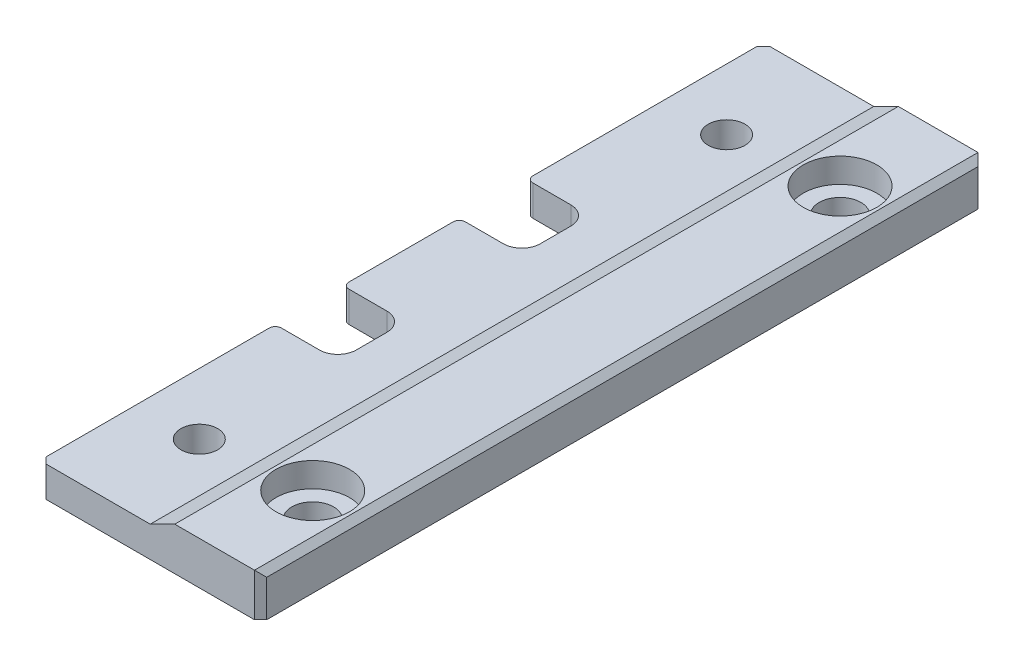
ISO-10303-21;
HEADER;
FILE_DESCRIPTION(('STEP AP214'),'2;1');
FILE_NAME('part.step','',(''),(''),'','','');
FILE_SCHEMA(('AUTOMOTIVE_DESIGN { 1 0 10303 214 1 1 1 1 }'));
ENDSEC;
DATA;
#1=APPLICATION_CONTEXT('core data for automotive mechanical design processes');
#2=APPLICATION_PROTOCOL_DEFINITION('international standard','automotive_design',2000,#1);
#3=PRODUCT_CONTEXT('',#1,'mechanical');
#4=PRODUCT('Part','Part','',(#3));
#5=PRODUCT_RELATED_PRODUCT_CATEGORY('part','',(#4));
#6=PRODUCT_DEFINITION_FORMATION('','',#4);
#7=PRODUCT_DEFINITION_CONTEXT('part definition',#1,'design');
#8=PRODUCT_DEFINITION('design','',#6,#7);
#9=PRODUCT_DEFINITION_SHAPE('','',#8);
#10=(LENGTH_UNIT() NAMED_UNIT(*) SI_UNIT(.MILLI.,.METRE.));
#11=(NAMED_UNIT(*) PLANE_ANGLE_UNIT() SI_UNIT($,.RADIAN.));
#12=(NAMED_UNIT(*) SI_UNIT($,.STERADIAN.) SOLID_ANGLE_UNIT());
#13=UNCERTAINTY_MEASURE_WITH_UNIT(LENGTH_MEASURE(1.E-05),#10,'distance_accuracy_value','');
#14=(GEOMETRIC_REPRESENTATION_CONTEXT(3) GLOBAL_UNCERTAINTY_ASSIGNED_CONTEXT((#13)) GLOBAL_UNIT_ASSIGNED_CONTEXT((#10,
#11,#12)) REPRESENTATION_CONTEXT('',''));
#15=CARTESIAN_POINT('',(0.,0.,0.));
#16=DIRECTION('',(0.,0.,1.));
#17=DIRECTION('',(1.,0.,0.));
#18=AXIS2_PLACEMENT_3D('',#15,#16,#17);
#19=CARTESIAN_POINT('',(-139.878100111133,4.07757026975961,-51.));
#20=DIRECTION('',(0.,1.,0.));
#21=DIRECTION('',(0.,0.,1.));
#22=AXIS2_PLACEMENT_3D('',#19,#20,#21);
#23=CYLINDRICAL_SURFACE('',#22,1.7);
#24=CARTESIAN_POINT('',(-139.878100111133,4.07757026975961,-51.));
#25=DIRECTION('',(0.,1.,0.));
#26=DIRECTION('',(0.,0.,1.));
#27=AXIS2_PLACEMENT_3D('',#24,#25,#26);
#28=CIRCLE('',#27,1.7);
#29=CARTESIAN_POINT('',(-139.878100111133,4.07757026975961,-49.3));
#30=VERTEX_POINT('',#29);
#31=EDGE_CURVE('E358',#30,#30,#28,.T.);
#32=ORIENTED_EDGE('',*,*,#31,.F.);
#33=EDGE_LOOP('',(#32));
#34=FACE_BOUND('',#33,.T.);
#35=CARTESIAN_POINT('',(-139.878100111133,5.57757026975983,-51.));
#36=DIRECTION('',(0.,1.,0.));
#37=DIRECTION('',(0.,0.,1.));
#38=AXIS2_PLACEMENT_3D('',#35,#36,#37);
#39=CIRCLE('',#38,1.7);
#40=CARTESIAN_POINT('',(-139.878100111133,5.57757026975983,-49.3));
#41=VERTEX_POINT('',#40);
#42=EDGE_CURVE('E361',#41,#41,#39,.F.);
#43=ORIENTED_EDGE('',*,*,#42,.F.);
#44=EDGE_LOOP('',(#43));
#45=FACE_BOUND('',#44,.T.);
#46=ADVANCED_FACE('F16',(#34,#45),#23,.F.);
#47=CARTESIAN_POINT('',(-154.128100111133,6.57757026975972,-59.));
#48=DIRECTION('',(-1.,0.,0.));
#49=DIRECTION('',(0.,0.,1.));
#50=AXIS2_PLACEMENT_3D('',#47,#48,#49);
#51=PLANE('',#50);
#52=DIRECTION('',(0.,0.,1.));
#53=VECTOR('',#52,1.);
#54=CARTESIAN_POINT('',(-154.128100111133,6.57757026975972,-59.));
#55=LINE('',#54,#53);
#56=CARTESIAN_POINT('',(-154.128100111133,6.57757026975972,-58.5));
#57=VERTEX_POINT('',#56);
#58=CARTESIAN_POINT('',(-154.128100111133,6.57757026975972,-40.2));
#59=VERTEX_POINT('',#58);
#60=EDGE_CURVE('E235',#57,#59,#55,.T.);
#61=ORIENTED_EDGE('',*,*,#60,.F.);
#62=DIRECTION('',(0.,-1.,0.));
#63=VECTOR('',#62,1.);
#64=CARTESIAN_POINT('',(-154.128100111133,4.07757026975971,-58.5));
#65=LINE('',#64,#63);
#66=CARTESIAN_POINT('',(-154.128100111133,4.07757026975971,-58.5));
#67=VERTEX_POINT('',#66);
#68=EDGE_CURVE('E325',#57,#67,#65,.T.);
#69=ORIENTED_EDGE('',*,*,#68,.T.);
#70=DIRECTION('',(0.,0.,1.));
#71=VECTOR('',#70,1.);
#72=CARTESIAN_POINT('',(-154.128100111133,4.07757026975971,-59.));
#73=LINE('',#72,#71);
#74=CARTESIAN_POINT('',(-154.128100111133,4.07757026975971,-40.2));
#75=VERTEX_POINT('',#74);
#76=EDGE_CURVE('E230',#67,#75,#73,.T.);
#77=ORIENTED_EDGE('',*,*,#76,.T.);
#78=DIRECTION('',(0.,-1.,0.));
#79=VECTOR('',#78,1.);
#80=CARTESIAN_POINT('',(-154.128100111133,6.57757026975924,-40.2));
#81=LINE('',#80,#79);
#82=EDGE_CURVE('E304',#75,#59,#81,.F.);
#83=ORIENTED_EDGE('',*,*,#82,.T.);
#84=EDGE_LOOP('',(#61,#69,#77,#83));
#85=FACE_BOUND('',#84,.T.);
#86=ADVANCED_FACE('F434',(#85),#51,.T.);
#87=CARTESIAN_POINT('',(-154.128100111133,6.57757026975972,-33.7));
#88=VERTEX_POINT('',#87);
#89=CARTESIAN_POINT('',(-154.128100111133,6.57757026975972,-25.2));
#90=VERTEX_POINT('',#89);
#91=EDGE_CURVE('E237',#88,#90,#55,.T.);
#92=ORIENTED_EDGE('',*,*,#91,.F.);
#93=DIRECTION('',(0.,1.,0.));
#94=VECTOR('',#93,1.);
#95=CARTESIAN_POINT('',(-154.128100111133,4.07757026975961,-33.7));
#96=LINE('',#95,#94);
#97=CARTESIAN_POINT('',(-154.128100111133,4.07757026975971,-33.7));
#98=VERTEX_POINT('',#97);
#99=EDGE_CURVE('E294',#88,#98,#96,.F.);
#100=ORIENTED_EDGE('',*,*,#99,.T.);
#101=CARTESIAN_POINT('',(-154.128100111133,4.07757026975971,-25.2));
#102=VERTEX_POINT('',#101);
#103=EDGE_CURVE('E233',#98,#102,#73,.T.);
#104=ORIENTED_EDGE('',*,*,#103,.T.);
#105=DIRECTION('',(0.,-1.,0.));
#106=VECTOR('',#105,1.);
#107=CARTESIAN_POINT('',(-154.128100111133,6.57757026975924,-25.2));
#108=LINE('',#107,#106);
#109=EDGE_CURVE('E262',#102,#90,#108,.F.);
#110=ORIENTED_EDGE('',*,*,#109,.T.);
#111=EDGE_LOOP('',(#92,#100,#104,#110));
#112=FACE_BOUND('',#111,.T.);
#113=ADVANCED_FACE('F441',(#112),#51,.T.);
#114=CARTESIAN_POINT('',(-154.128100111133,4.07757026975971,-59.));
#115=DIRECTION('',(0.,-1.,0.));
#116=DIRECTION('',(0.,0.,-1.));
#117=AXIS2_PLACEMENT_3D('',#114,#115,#116);
#118=PLANE('',#117);
#119=CARTESIAN_POINT('',(-149.128100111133,4.07757026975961,-51.));
#120=DIRECTION('',(0.,1.,0.));
#121=DIRECTION('',(0.,0.,1.));
#122=AXIS2_PLACEMENT_3D('',#119,#120,#121);
#123=CIRCLE('',#122,1.5);
#124=CARTESIAN_POINT('',(-149.128100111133,4.07757026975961,-49.5));
#125=VERTEX_POINT('',#124);
#126=EDGE_CURVE('E619',#125,#125,#123,.T.);
#127=ORIENTED_EDGE('',*,*,#126,.T.);
#128=EDGE_LOOP('',(#127));
#129=FACE_BOUND('',#128,.T.);
#130=CARTESIAN_POINT('',(-149.128100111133,4.07757026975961,-8.));
#131=DIRECTION('',(0.,1.,0.));
#132=DIRECTION('',(0.,0.,1.));
#133=AXIS2_PLACEMENT_3D('',#130,#131,#132);
#134=CIRCLE('',#133,1.5);
#135=CARTESIAN_POINT('',(-149.128100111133,4.07757026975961,-6.5));
#136=VERTEX_POINT('',#135);
#137=EDGE_CURVE('E612',#136,#136,#134,.T.);
#138=ORIENTED_EDGE('',*,*,#137,.T.);
#139=EDGE_LOOP('',(#138));
#140=FACE_BOUND('',#139,.T.);
#141=CARTESIAN_POINT('',(-139.878100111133,4.07757026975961,-8.));
#142=DIRECTION('',(0.,1.,0.));
#143=DIRECTION('',(0.,0.,-1.));
#144=AXIS2_PLACEMENT_3D('',#141,#142,#143);
#145=CIRCLE('',#144,1.7);
#146=CARTESIAN_POINT('',(-139.878100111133,4.07757026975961,-9.7));
#147=VERTEX_POINT('',#146);
#148=EDGE_CURVE('E363',#147,#147,#145,.T.);
#149=ORIENTED_EDGE('',*,*,#148,.T.);
#150=EDGE_LOOP('',(#149));
#151=FACE_BOUND('',#150,.T.);
#152=ORIENTED_EDGE('',*,*,#31,.T.);
#153=EDGE_LOOP('',(#152));
#154=FACE_BOUND('',#153,.T.);
#155=ORIENTED_EDGE('',*,*,#76,.F.);
#156=DIRECTION('',(0.707106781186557,0.,-0.707106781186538));
#157=VECTOR('',#156,1.);
#158=CARTESIAN_POINT('',(-153.878100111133,4.07757026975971,-58.75));
#159=LINE('',#158,#157);
#160=CARTESIAN_POINT('',(-153.628100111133,4.07757026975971,-59.));
#161=VERTEX_POINT('',#160);
#162=EDGE_CURVE('E334',#67,#161,#159,.T.);
#163=ORIENTED_EDGE('',*,*,#162,.T.);
#164=DIRECTION('',(1.,0.,0.));
#165=VECTOR('',#164,1.);
#166=CARTESIAN_POINT('',(-154.128100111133,4.07757026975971,-59.));
#167=LINE('',#166,#165);
#168=CARTESIAN_POINT('',(-136.628100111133,4.07757026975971,-59.));
#169=VERTEX_POINT('',#168);
#170=EDGE_CURVE('E202',#161,#169,#167,.T.);
#171=ORIENTED_EDGE('',*,*,#170,.T.);
#172=DIRECTION('',(0.707106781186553,0.,0.707106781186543));
#173=VECTOR('',#172,1.);
#174=CARTESIAN_POINT('',(-145.378100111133,4.07757026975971,-67.75));
#175=LINE('',#174,#173);
#176=CARTESIAN_POINT('',(-136.128100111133,4.07757026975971,-58.5));
#177=VERTEX_POINT('',#176);
#178=EDGE_CURVE('E332',#169,#177,#175,.T.);
#179=ORIENTED_EDGE('',*,*,#178,.T.);
#180=DIRECTION('',(0.,0.,1.));
#181=VECTOR('',#180,1.);
#182=CARTESIAN_POINT('',(-136.128100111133,4.07757026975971,-59.));
#183=LINE('',#182,#181);
#184=CARTESIAN_POINT('',(-136.128100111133,4.07757026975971,-0.500000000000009));
#185=VERTEX_POINT('',#184);
#186=EDGE_CURVE('E210',#177,#185,#183,.T.);
#187=ORIENTED_EDGE('',*,*,#186,.T.);
#188=DIRECTION('',(0.707106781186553,0.,-0.707106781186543));
#189=VECTOR('',#188,1.);
#190=CARTESIAN_POINT('',(-115.878100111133,4.07757026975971,-20.7499999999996));
#191=LINE('',#190,#189);
#192=CARTESIAN_POINT('',(-136.628100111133,4.07757026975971,0.));
#193=VERTEX_POINT('',#192);
#194=EDGE_CURVE('E330',#185,#193,#191,.F.);
#195=ORIENTED_EDGE('',*,*,#194,.T.);
#196=DIRECTION('',(1.,0.,0.));
#197=VECTOR('',#196,1.);
#198=CARTESIAN_POINT('',(-154.128100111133,4.07757026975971,0.));
#199=LINE('',#198,#197);
#200=CARTESIAN_POINT('',(-153.628100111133,4.07757026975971,0.));
#201=VERTEX_POINT('',#200);
#202=EDGE_CURVE('E221',#201,#193,#199,.T.);
#203=ORIENTED_EDGE('',*,*,#202,.F.);
#204=DIRECTION('',(0.707106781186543,0.,0.707106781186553));
#205=VECTOR('',#204,1.);
#206=CARTESIAN_POINT('',(-183.378100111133,4.07757026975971,-29.7500000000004));
#207=LINE('',#206,#205);
#208=CARTESIAN_POINT('',(-154.128100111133,4.07757026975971,-0.500000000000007));
#209=VERTEX_POINT('',#208);
#210=EDGE_CURVE('E328',#201,#209,#207,.F.);
#211=ORIENTED_EDGE('',*,*,#210,.T.);
#212=CARTESIAN_POINT('',(-154.128100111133,4.07757026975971,-18.7));
#213=VERTEX_POINT('',#212);
#214=EDGE_CURVE('E234',#213,#209,#73,.T.);
#215=ORIENTED_EDGE('',*,*,#214,.F.);
#216=CARTESIAN_POINT('',(-153.628100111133,4.07757026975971,-18.7));
#217=DIRECTION('',(0.,-1.,0.));
#218=DIRECTION('',(0.,0.,-1.));
#219=AXIS2_PLACEMENT_3D('',#216,#217,#218);
#220=CIRCLE('',#219,0.5);
#221=CARTESIAN_POINT('',(-153.628100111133,4.07757026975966,-19.2));
#222=VERTEX_POINT('',#221);
#223=EDGE_CURVE('E257',#213,#222,#220,.T.);
#224=ORIENTED_EDGE('',*,*,#223,.T.);
#225=DIRECTION('',(1.,0.,0.));
#226=VECTOR('',#225,1.);
#227=CARTESIAN_POINT('',(-155.131755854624,4.07757026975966,-19.2));
#228=LINE('',#227,#226);
#229=CARTESIAN_POINT('',(-150.528100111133,4.07757026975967,-19.2));
#230=VERTEX_POINT('',#229);
#231=EDGE_CURVE('E395',#222,#230,#228,.T.);
#232=ORIENTED_EDGE('',*,*,#231,.T.);
#233=CARTESIAN_POINT('',(-150.528100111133,4.07757026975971,-20.7));
#234=DIRECTION('',(0.,-1.,0.));
#235=DIRECTION('',(0.,0.,-1.));
#236=AXIS2_PLACEMENT_3D('',#233,#234,#235);
#237=CIRCLE('',#236,1.5);
#238=CARTESIAN_POINT('',(-149.028100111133,4.07757026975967,-20.7));
#239=VERTEX_POINT('',#238);
#240=EDGE_CURVE('E277',#230,#239,#237,.F.);
#241=ORIENTED_EDGE('',*,*,#240,.T.);
#242=DIRECTION('',(0.,0.,-1.));
#243=VECTOR('',#242,1.);
#244=CARTESIAN_POINT('',(-149.028100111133,4.07757026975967,-19.2));
#245=LINE('',#244,#243);
#246=CARTESIAN_POINT('',(-149.028100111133,4.07757026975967,-23.2));
#247=VERTEX_POINT('',#246);
#248=EDGE_CURVE('E398',#239,#247,#245,.T.);
#249=ORIENTED_EDGE('',*,*,#248,.T.);
#250=CARTESIAN_POINT('',(-150.528100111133,4.07757026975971,-23.2));
#251=DIRECTION('',(0.,-1.,0.));
#252=DIRECTION('',(0.,0.,-1.));
#253=AXIS2_PLACEMENT_3D('',#250,#251,#252);
#254=CIRCLE('',#253,1.5);
#255=CARTESIAN_POINT('',(-150.528100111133,4.07757026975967,-24.7));
#256=VERTEX_POINT('',#255);
#257=EDGE_CURVE('E281',#247,#256,#254,.F.);
#258=ORIENTED_EDGE('',*,*,#257,.T.);
#259=DIRECTION('',(-1.,0.,0.));
#260=VECTOR('',#259,1.);
#261=CARTESIAN_POINT('',(-155.131755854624,4.07757026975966,-24.7));
#262=LINE('',#261,#260);
#263=CARTESIAN_POINT('',(-153.628100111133,4.07757026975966,-24.7));
#264=VERTEX_POINT('',#263);
#265=EDGE_CURVE('E224',#256,#264,#262,.T.);
#266=ORIENTED_EDGE('',*,*,#265,.T.);
#267=CARTESIAN_POINT('',(-153.628100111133,4.07757026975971,-25.2));
#268=DIRECTION('',(0.,-1.,0.));
#269=DIRECTION('',(0.,0.,-1.));
#270=AXIS2_PLACEMENT_3D('',#267,#268,#269);
#271=CIRCLE('',#270,0.5);
#272=EDGE_CURVE('E254',#264,#102,#271,.T.);
#273=ORIENTED_EDGE('',*,*,#272,.T.);
#274=ORIENTED_EDGE('',*,*,#103,.F.);
#275=CARTESIAN_POINT('',(-153.628100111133,4.07757026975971,-33.7));
#276=DIRECTION('',(0.,-1.,0.));
#277=DIRECTION('',(0.,0.,-1.));
#278=AXIS2_PLACEMENT_3D('',#275,#276,#277);
#279=CIRCLE('',#278,0.5);
#280=CARTESIAN_POINT('',(-153.628100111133,4.07757026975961,-34.2));
#281=VERTEX_POINT('',#280);
#282=EDGE_CURVE('E299',#98,#281,#279,.T.);
#283=ORIENTED_EDGE('',*,*,#282,.T.);
#284=DIRECTION('',(1.,0.,0.));
#285=VECTOR('',#284,1.);
#286=CARTESIAN_POINT('',(-155.131755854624,4.0775702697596,-34.2));
#287=LINE('',#286,#285);
#288=CARTESIAN_POINT('',(-150.528100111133,4.07757026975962,-34.2));
#289=VERTEX_POINT('',#288);
#290=EDGE_CURVE('E382',#281,#289,#287,.T.);
#291=ORIENTED_EDGE('',*,*,#290,.T.);
#292=CARTESIAN_POINT('',(-150.528100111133,4.07757026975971,-35.7));
#293=DIRECTION('',(0.,-1.,0.));
#294=DIRECTION('',(0.,0.,-1.));
#295=AXIS2_PLACEMENT_3D('',#292,#293,#294);
#296=CIRCLE('',#295,1.5);
#297=CARTESIAN_POINT('',(-149.028100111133,4.07757026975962,-35.7));
#298=VERTEX_POINT('',#297);
#299=EDGE_CURVE('E319',#289,#298,#296,.F.);
#300=ORIENTED_EDGE('',*,*,#299,.T.);
#301=DIRECTION('',(0.,0.,-1.));
#302=VECTOR('',#301,1.);
#303=CARTESIAN_POINT('',(-149.028100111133,4.07757026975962,-34.2));
#304=LINE('',#303,#302);
#305=CARTESIAN_POINT('',(-149.028100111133,4.07757026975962,-38.2));
#306=VERTEX_POINT('',#305);
#307=EDGE_CURVE('E385',#298,#306,#304,.T.);
#308=ORIENTED_EDGE('',*,*,#307,.T.);
#309=CARTESIAN_POINT('',(-150.528100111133,4.07757026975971,-38.2));
#310=DIRECTION('',(0.,-1.,0.));
#311=DIRECTION('',(0.,0.,-1.));
#312=AXIS2_PLACEMENT_3D('',#309,#310,#311);
#313=CIRCLE('',#312,1.5);
#314=CARTESIAN_POINT('',(-150.528100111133,4.07757026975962,-39.7));
#315=VERTEX_POINT('',#314);
#316=EDGE_CURVE('E323',#306,#315,#313,.F.);
#317=ORIENTED_EDGE('',*,*,#316,.T.);
#318=DIRECTION('',(-1.,0.,0.));
#319=VECTOR('',#318,1.);
#320=CARTESIAN_POINT('',(-155.131755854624,4.0775702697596,-39.7));
#321=LINE('',#320,#319);
#322=CARTESIAN_POINT('',(-153.628100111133,4.07757026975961,-39.7));
#323=VERTEX_POINT('',#322);
#324=EDGE_CURVE('E389',#315,#323,#321,.T.);
#325=ORIENTED_EDGE('',*,*,#324,.T.);
#326=CARTESIAN_POINT('',(-153.628100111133,4.07757026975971,-40.2));
#327=DIRECTION('',(0.,-1.,0.));
#328=DIRECTION('',(0.,0.,-1.));
#329=AXIS2_PLACEMENT_3D('',#326,#327,#328);
#330=CIRCLE('',#329,0.5);
#331=EDGE_CURVE('E296',#323,#75,#330,.T.);
#332=ORIENTED_EDGE('',*,*,#331,.T.);
#333=EDGE_LOOP('',(#155,#163,#171,#179,#187,#195,#203,#211,#215,#224,#232,#241,#249,#258,#266,
#273,#274,#283,#291,#300,#308,#317,#325,#332));
#334=FACE_BOUND('',#333,.T.);
#335=ADVANCED_FACE('F409',(#129,#140,#151,#154,#334),#118,.T.);
#336=ORIENTED_EDGE('',*,*,#214,.T.);
#337=DIRECTION('',(0.,1.,0.));
#338=VECTOR('',#337,1.);
#339=CARTESIAN_POINT('',(-154.128100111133,6.57757026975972,-0.500000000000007));
#340=LINE('',#339,#338);
#341=CARTESIAN_POINT('',(-154.128100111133,6.57757026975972,-0.5));
#342=VERTEX_POINT('',#341);
#343=EDGE_CURVE('E11',#209,#342,#340,.T.);
#344=ORIENTED_EDGE('',*,*,#343,.T.);
#345=CARTESIAN_POINT('',(-154.128100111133,6.57757026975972,-18.7));
#346=VERTEX_POINT('',#345);
#347=EDGE_CURVE('E238',#346,#342,#55,.T.);
#348=ORIENTED_EDGE('',*,*,#347,.F.);
#349=DIRECTION('',(0.,1.,0.));
#350=VECTOR('',#349,1.);
#351=CARTESIAN_POINT('',(-154.128100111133,4.07757026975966,-18.7));
#352=LINE('',#351,#350);
#353=EDGE_CURVE('E252',#346,#213,#352,.F.);
#354=ORIENTED_EDGE('',*,*,#353,.T.);
#355=EDGE_LOOP('',(#336,#344,#348,#354));
#356=FACE_BOUND('',#355,.T.);
#357=ADVANCED_FACE('F444',(#356),#51,.T.);
#358=CARTESIAN_POINT('',(-145.128100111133,6.57757026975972,-59.));
#359=DIRECTION('',(0.,1.,0.));
#360=DIRECTION('',(0.,0.,1.));
#361=AXIS2_PLACEMENT_3D('',#358,#359,#360);
#362=PLANE('',#361);
#363=CARTESIAN_POINT('',(-149.128100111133,6.57757026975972,-51.));
#364=DIRECTION('',(0.,1.,0.));
#365=DIRECTION('',(0.,0.,1.));
#366=AXIS2_PLACEMENT_3D('',#363,#364,#365);
#367=CIRCLE('',#366,1.49999999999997);
#368=CARTESIAN_POINT('',(-149.128100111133,6.57757026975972,-49.5));
#369=VERTEX_POINT('',#368);
#370=EDGE_CURVE('E622',#369,#369,#367,.T.);
#371=ORIENTED_EDGE('',*,*,#370,.F.);
#372=EDGE_LOOP('',(#371));
#373=FACE_BOUND('',#372,.T.);
#374=CARTESIAN_POINT('',(-149.128100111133,6.57757026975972,-8.));
#375=DIRECTION('',(0.,1.,0.));
#376=DIRECTION('',(0.,0.,1.));
#377=AXIS2_PLACEMENT_3D('',#374,#375,#376);
#378=CIRCLE('',#377,1.49999999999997);
#379=CARTESIAN_POINT('',(-149.128100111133,6.57757026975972,-6.50000000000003));
#380=VERTEX_POINT('',#379);
#381=EDGE_CURVE('E616',#380,#380,#378,.T.);
#382=ORIENTED_EDGE('',*,*,#381,.F.);
#383=EDGE_LOOP('',(#382));
#384=FACE_BOUND('',#383,.T.);
#385=DIRECTION('',(-1.,0.,0.));
#386=VECTOR('',#385,1.);
#387=CARTESIAN_POINT('',(-145.128100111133,6.57757026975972,-59.));
#388=LINE('',#387,#386);
#389=CARTESIAN_POINT('',(-145.128100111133,6.57757026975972,-59.));
#390=VERTEX_POINT('',#389);
#391=CARTESIAN_POINT('',(-153.628100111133,6.57757026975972,-59.));
#392=VERTEX_POINT('',#391);
#393=EDGE_CURVE('E216',#390,#392,#388,.T.);
#394=ORIENTED_EDGE('',*,*,#393,.T.);
#395=DIRECTION('',(-0.707106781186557,0.,0.707106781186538));
#396=VECTOR('',#395,1.);
#397=CARTESIAN_POINT('',(-149.378100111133,6.57757026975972,-63.25));
#398=LINE('',#397,#396);
#399=EDGE_CURVE('E342',#392,#57,#398,.T.);
#400=ORIENTED_EDGE('',*,*,#399,.T.);
#401=ORIENTED_EDGE('',*,*,#60,.T.);
#402=CARTESIAN_POINT('',(-153.628100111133,6.57757026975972,-40.2));
#403=DIRECTION('',(0.,1.,0.));
#404=DIRECTION('',(0.,0.,1.));
#405=AXIS2_PLACEMENT_3D('',#402,#403,#404);
#406=CIRCLE('',#405,0.5);
#407=CARTESIAN_POINT('',(-153.628100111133,6.57757026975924,-39.7));
#408=VERTEX_POINT('',#407);
#409=EDGE_CURVE('E289',#59,#408,#406,.T.);
#410=ORIENTED_EDGE('',*,*,#409,.T.);
#411=DIRECTION('',(-1.,0.,0.));
#412=VECTOR('',#411,1.);
#413=CARTESIAN_POINT('',(-155.131755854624,6.57757026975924,-39.7));
#414=LINE('',#413,#412);
#415=CARTESIAN_POINT('',(-150.528100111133,6.57757026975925,-39.7));
#416=VERTEX_POINT('',#415);
#417=EDGE_CURVE('E386',#416,#408,#414,.T.);
#418=ORIENTED_EDGE('',*,*,#417,.F.);
#419=CARTESIAN_POINT('',(-150.528100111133,6.57757026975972,-38.2));
#420=DIRECTION('',(0.,1.,0.));
#421=DIRECTION('',(0.,0.,1.));
#422=AXIS2_PLACEMENT_3D('',#419,#420,#421);
#423=CIRCLE('',#422,1.5);
#424=CARTESIAN_POINT('',(-149.028100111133,6.57757026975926,-38.2));
#425=VERTEX_POINT('',#424);
#426=EDGE_CURVE('E321',#416,#425,#423,.F.);
#427=ORIENTED_EDGE('',*,*,#426,.T.);
#428=DIRECTION('',(0.,0.,-1.));
#429=VECTOR('',#428,1.);
#430=CARTESIAN_POINT('',(-149.028100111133,6.57757026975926,-34.2));
#431=LINE('',#430,#429);
#432=CARTESIAN_POINT('',(-149.028100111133,6.57757026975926,-35.7));
#433=VERTEX_POINT('',#432);
#434=EDGE_CURVE('E360',#433,#425,#431,.T.);
#435=ORIENTED_EDGE('',*,*,#434,.F.);
#436=CARTESIAN_POINT('',(-150.528100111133,6.57757026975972,-35.7));
#437=DIRECTION('',(0.,1.,0.));
#438=DIRECTION('',(0.,0.,1.));
#439=AXIS2_PLACEMENT_3D('',#436,#437,#438);
#440=CIRCLE('',#439,1.5);
#441=CARTESIAN_POINT('',(-150.528100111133,6.57757026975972,-34.2));
#442=VERTEX_POINT('',#441);
#443=EDGE_CURVE('E317',#433,#442,#440,.F.);
#444=ORIENTED_EDGE('',*,*,#443,.T.);
#445=DIRECTION('',(1.,0.,0.));
#446=VECTOR('',#445,1.);
#447=CARTESIAN_POINT('',(-145.128100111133,6.57757026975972,-34.2));
#448=LINE('',#447,#446);
#449=CARTESIAN_POINT('',(-153.628100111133,6.57757026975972,-34.2));
#450=VERTEX_POINT('',#449);
#451=EDGE_CURVE('E283',#450,#442,#448,.T.);
#452=ORIENTED_EDGE('',*,*,#451,.F.);
#453=CARTESIAN_POINT('',(-153.628100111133,6.57757026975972,-33.7));
#454=DIRECTION('',(0.,1.,0.));
#455=DIRECTION('',(0.,0.,1.));
#456=AXIS2_PLACEMENT_3D('',#453,#454,#455);
#457=CIRCLE('',#456,0.5);
#458=EDGE_CURVE('E292',#450,#88,#457,.T.);
#459=ORIENTED_EDGE('',*,*,#458,.T.);
#460=ORIENTED_EDGE('',*,*,#91,.T.);
#461=CARTESIAN_POINT('',(-153.628100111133,6.57757026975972,-25.2));
#462=DIRECTION('',(0.,1.,0.));
#463=DIRECTION('',(0.,0.,1.));
#464=AXIS2_PLACEMENT_3D('',#461,#462,#463);
#465=CIRCLE('',#464,0.5);
#466=CARTESIAN_POINT('',(-153.628100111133,6.57757026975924,-24.7));
#467=VERTEX_POINT('',#466);
#468=EDGE_CURVE('E247',#90,#467,#465,.T.);
#469=ORIENTED_EDGE('',*,*,#468,.T.);
#470=DIRECTION('',(-1.,0.,0.));
#471=VECTOR('',#470,1.);
#472=CARTESIAN_POINT('',(-155.131755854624,6.57757026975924,-24.7));
#473=LINE('',#472,#471);
#474=CARTESIAN_POINT('',(-150.528100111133,6.57757026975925,-24.7));
#475=VERTEX_POINT('',#474);
#476=EDGE_CURVE('E399',#475,#467,#473,.T.);
#477=ORIENTED_EDGE('',*,*,#476,.F.);
#478=CARTESIAN_POINT('',(-150.528100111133,6.57757026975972,-23.2));
#479=DIRECTION('',(0.,1.,0.));
#480=DIRECTION('',(0.,0.,1.));
#481=AXIS2_PLACEMENT_3D('',#478,#479,#480);
#482=CIRCLE('',#481,1.5);
#483=CARTESIAN_POINT('',(-149.028100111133,6.57757026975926,-23.2));
#484=VERTEX_POINT('',#483);
#485=EDGE_CURVE('E279',#475,#484,#482,.F.);
#486=ORIENTED_EDGE('',*,*,#485,.T.);
#487=DIRECTION('',(0.,0.,-1.));
#488=VECTOR('',#487,1.);
#489=CARTESIAN_POINT('',(-149.028100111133,6.57757026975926,-19.2));
#490=LINE('',#489,#488);
#491=CARTESIAN_POINT('',(-149.028100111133,6.57757026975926,-20.7));
#492=VERTEX_POINT('',#491);
#493=EDGE_CURVE('E391',#492,#484,#490,.T.);
#494=ORIENTED_EDGE('',*,*,#493,.F.);
#495=CARTESIAN_POINT('',(-150.528100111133,6.57757026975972,-20.7));
#496=DIRECTION('',(0.,1.,0.));
#497=DIRECTION('',(0.,0.,1.));
#498=AXIS2_PLACEMENT_3D('',#495,#496,#497);
#499=CIRCLE('',#498,1.5);
#500=CARTESIAN_POINT('',(-150.528100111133,6.57757026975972,-19.2));
#501=VERTEX_POINT('',#500);
#502=EDGE_CURVE('E275',#492,#501,#499,.F.);
#503=ORIENTED_EDGE('',*,*,#502,.T.);
#504=DIRECTION('',(1.,0.,0.));
#505=VECTOR('',#504,1.);
#506=CARTESIAN_POINT('',(-145.128100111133,6.57757026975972,-19.2));
#507=LINE('',#506,#505);
#508=CARTESIAN_POINT('',(-153.628100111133,6.57757026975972,-19.2));
#509=VERTEX_POINT('',#508);
#510=EDGE_CURVE('E232',#509,#501,#507,.T.);
#511=ORIENTED_EDGE('',*,*,#510,.F.);
#512=CARTESIAN_POINT('',(-153.628100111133,6.57757026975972,-18.7));
#513=DIRECTION('',(0.,1.,0.));
#514=DIRECTION('',(0.,0.,1.));
#515=AXIS2_PLACEMENT_3D('',#512,#513,#514);
#516=CIRCLE('',#515,0.5);
#517=EDGE_CURVE('E250',#509,#346,#516,.T.);
#518=ORIENTED_EDGE('',*,*,#517,.T.);
#519=ORIENTED_EDGE('',*,*,#347,.T.);
#520=DIRECTION('',(-0.707106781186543,0.,-0.707106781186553));
#521=VECTOR('',#520,1.);
#522=CARTESIAN_POINT('',(-178.878100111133,6.57757026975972,-25.2500000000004));
#523=LINE('',#522,#521);
#524=CARTESIAN_POINT('',(-153.628100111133,6.57757026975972,0.));
#525=VERTEX_POINT('',#524);
#526=EDGE_CURVE('E340',#342,#525,#523,.F.);
#527=ORIENTED_EDGE('',*,*,#526,.T.);
#528=DIRECTION('',(-1.,0.,0.));
#529=VECTOR('',#528,1.);
#530=CARTESIAN_POINT('',(-145.128100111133,6.57757026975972,0.));
#531=LINE('',#530,#529);
#532=CARTESIAN_POINT('',(-145.128100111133,6.57757026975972,0.));
#533=VERTEX_POINT('',#532);
#534=EDGE_CURVE('E227',#533,#525,#531,.T.);
#535=ORIENTED_EDGE('',*,*,#534,.F.);
#536=DIRECTION('',(0.,0.,1.));
#537=VECTOR('',#536,1.);
#538=CARTESIAN_POINT('',(-145.128100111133,6.57757026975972,-59.));
#539=LINE('',#538,#537);
#540=EDGE_CURVE('E209',#390,#533,#539,.T.);
#541=ORIENTED_EDGE('',*,*,#540,.F.);
#542=EDGE_LOOP('',(#394,#400,#401,#410,#418,#427,#435,#444,#452,#459,#460,#469,#477,#486,#494,
#503,#511,#518,#519,#527,#535,#541));
#543=FACE_BOUND('',#542,.T.);
#544=ADVANCED_FACE('F484',(#373,#384,#543),#362,.T.);
#545=CARTESIAN_POINT('',(-145.128100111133,6.57757026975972,-59.));
#546=DIRECTION('',(-0.447213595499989,0.894427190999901,0.));
#547=DIRECTION('',(-0.894427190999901,-0.447213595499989,0.));
#548=AXIS2_PLACEMENT_3D('',#545,#546,#547);
#549=PLANE('',#548);
#550=DIRECTION('',(-0.894427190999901,-0.447213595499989,0.));
#551=VECTOR('',#550,1.);
#552=CARTESIAN_POINT('',(-145.128100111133,6.57757026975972,0.));
#553=LINE('',#552,#551);
#554=CARTESIAN_POINT('',(-143.128100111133,7.57757026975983,0.));
#555=VERTEX_POINT('',#554);
#556=EDGE_CURVE('E208',#555,#533,#553,.T.);
#557=ORIENTED_EDGE('',*,*,#556,.F.);
#558=DIRECTION('',(0.,0.,1.));
#559=VECTOR('',#558,1.);
#560=CARTESIAN_POINT('',(-143.128100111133,7.57757026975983,-59.));
#561=LINE('',#560,#559);
#562=CARTESIAN_POINT('',(-143.128100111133,7.57757026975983,-59.));
#563=VERTEX_POINT('',#562);
#564=EDGE_CURVE('E195',#563,#555,#561,.T.);
#565=ORIENTED_EDGE('',*,*,#564,.F.);
#566=DIRECTION('',(-0.894427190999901,-0.447213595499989,0.));
#567=VECTOR('',#566,1.);
#568=CARTESIAN_POINT('',(-145.128100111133,6.57757026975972,-59.));
#569=LINE('',#568,#567);
#570=EDGE_CURVE('E201',#563,#390,#569,.T.);
#571=ORIENTED_EDGE('',*,*,#570,.T.);
#572=ORIENTED_EDGE('',*,*,#540,.T.);
#573=EDGE_LOOP('',(#557,#565,#571,#572));
#574=FACE_BOUND('',#573,.T.);
#575=ADVANCED_FACE('F206',(#574),#549,.T.);
#576=CARTESIAN_POINT('',(-136.128100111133,7.57757026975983,-59.));
#577=DIRECTION('',(0.,1.,0.));
#578=DIRECTION('',(0.,0.,1.));
#579=AXIS2_PLACEMENT_3D('',#576,#577,#578);
#580=PLANE('',#579);
#581=CARTESIAN_POINT('',(-139.878100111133,7.57757026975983,-8.));
#582=DIRECTION('',(0.,1.,0.));
#583=DIRECTION('',(0.,0.,-1.));
#584=AXIS2_PLACEMENT_3D('',#581,#582,#583);
#585=CIRCLE('',#584,3.);
#586=CARTESIAN_POINT('',(-139.878100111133,7.57757026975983,-11.));
#587=VERTEX_POINT('',#586);
#588=EDGE_CURVE('E377',#587,#587,#585,.T.);
#589=ORIENTED_EDGE('',*,*,#588,.F.);
#590=EDGE_LOOP('',(#589));
#591=FACE_BOUND('',#590,.T.);
#592=CARTESIAN_POINT('',(-139.878100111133,7.57757026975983,-51.));
#593=DIRECTION('',(0.,1.,0.));
#594=DIRECTION('',(0.,0.,1.));
#595=AXIS2_PLACEMENT_3D('',#592,#593,#594);
#596=CIRCLE('',#595,3.);
#597=CARTESIAN_POINT('',(-139.878100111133,7.57757026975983,-48.));
#598=VERTEX_POINT('',#597);
#599=EDGE_CURVE('E370',#598,#598,#596,.T.);
#600=ORIENTED_EDGE('',*,*,#599,.F.);
#601=EDGE_LOOP('',(#600));
#602=FACE_BOUND('',#601,.T.);
#603=DIRECTION('',(-1.,0.,0.));
#604=VECTOR('',#603,1.);
#605=CARTESIAN_POINT('',(-136.128100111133,7.57757026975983,0.));
#606=LINE('',#605,#604);
#607=CARTESIAN_POINT('',(-136.628100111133,7.57757026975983,0.));
#608=VERTEX_POINT('',#607);
#609=EDGE_CURVE('E223',#608,#555,#606,.T.);
#610=ORIENTED_EDGE('',*,*,#609,.F.);
#611=DIRECTION('',(0.,0.,-1.));
#612=VECTOR('',#611,1.);
#613=CARTESIAN_POINT('',(-136.628100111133,7.57757026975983,-59.));
#614=LINE('',#613,#612);
#615=CARTESIAN_POINT('',(-136.628100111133,7.57757026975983,-59.));
#616=VERTEX_POINT('',#615);
#617=EDGE_CURVE('E198',#608,#616,#614,.T.);
#618=ORIENTED_EDGE('',*,*,#617,.T.);
#619=DIRECTION('',(-1.,0.,0.));
#620=VECTOR('',#619,1.);
#621=CARTESIAN_POINT('',(-136.128100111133,7.57757026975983,-59.));
#622=LINE('',#621,#620);
#623=EDGE_CURVE('E192',#616,#563,#622,.T.);
#624=ORIENTED_EDGE('',*,*,#623,.T.);
#625=ORIENTED_EDGE('',*,*,#564,.T.);
#626=EDGE_LOOP('',(#610,#618,#624,#625));
#627=FACE_BOUND('',#626,.T.);
#628=ADVANCED_FACE('F194',(#591,#602,#627),#580,.T.);
#629=CARTESIAN_POINT('',(-136.128100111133,4.07757026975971,-59.));
#630=DIRECTION('',(1.,0.,0.));
#631=DIRECTION('',(0.,1.,0.));
#632=AXIS2_PLACEMENT_3D('',#629,#630,#631);
#633=PLANE('',#632);
#634=ORIENTED_EDGE('',*,*,#186,.F.);
#635=DIRECTION('',(0.,1.,0.));
#636=VECTOR('',#635,1.);
#637=CARTESIAN_POINT('',(-136.128100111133,7.57757026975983,-58.5));
#638=LINE('',#637,#636);
#639=CARTESIAN_POINT('',(-136.128100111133,7.07757026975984,-58.5));
#640=VERTEX_POINT('',#639);
#641=EDGE_CURVE('E348',#177,#640,#638,.T.);
#642=ORIENTED_EDGE('',*,*,#641,.T.);
#643=DIRECTION('',(0.,0.,1.));
#644=VECTOR('',#643,1.);
#645=CARTESIAN_POINT('',(-136.128100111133,7.07757026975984,-59.));
#646=LINE('',#645,#644);
#647=CARTESIAN_POINT('',(-136.128100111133,7.07757026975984,-0.499999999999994));
#648=VERTEX_POINT('',#647);
#649=EDGE_CURVE('E346',#640,#648,#646,.T.);
#650=ORIENTED_EDGE('',*,*,#649,.T.);
#651=DIRECTION('',(0.,-1.,0.));
#652=VECTOR('',#651,1.);
#653=CARTESIAN_POINT('',(-136.128100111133,4.07757026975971,-0.499999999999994));
#654=LINE('',#653,#652);
#655=EDGE_CURVE('E344',#648,#185,#654,.T.);
#656=ORIENTED_EDGE('',*,*,#655,.T.);
#657=EDGE_LOOP('',(#634,#642,#650,#656));
#658=FACE_BOUND('',#657,.T.);
#659=ADVANCED_FACE('F414',(#658),#633,.T.);
#660=CARTESIAN_POINT('',(-136.128100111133,4.07757026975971,-59.));
#661=DIRECTION('',(0.,0.,1.));
#662=DIRECTION('',(1.,0.,0.));
#663=AXIS2_PLACEMENT_3D('',#660,#661,#662);
#664=PLANE('',#663);
#665=ORIENTED_EDGE('',*,*,#170,.F.);
#666=DIRECTION('',(0.,1.,0.));
#667=VECTOR('',#666,1.);
#668=CARTESIAN_POINT('',(-153.628100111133,6.57757026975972,-59.));
#669=LINE('',#668,#667);
#670=EDGE_CURVE('E338',#161,#392,#669,.T.);
#671=ORIENTED_EDGE('',*,*,#670,.T.);
#672=ORIENTED_EDGE('',*,*,#393,.F.);
#673=ORIENTED_EDGE('',*,*,#570,.F.);
#674=ORIENTED_EDGE('',*,*,#623,.F.);
#675=DIRECTION('',(0.,-1.,0.));
#676=VECTOR('',#675,1.);
#677=CARTESIAN_POINT('',(-136.628100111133,4.07757026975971,-59.));
#678=LINE('',#677,#676);
#679=EDGE_CURVE('E336',#616,#169,#678,.T.);
#680=ORIENTED_EDGE('',*,*,#679,.T.);
#681=EDGE_LOOP('',(#665,#671,#672,#673,#674,#680));
#682=FACE_BOUND('',#681,.T.);
#683=ADVANCED_FACE('F214',(#682),#664,.F.);
#684=CARTESIAN_POINT('',(-136.128100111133,4.07757026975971,0.));
#685=DIRECTION('',(0.,0.,1.));
#686=DIRECTION('',(1.,0.,0.));
#687=AXIS2_PLACEMENT_3D('',#684,#685,#686);
#688=PLANE('',#687);
#689=ORIENTED_EDGE('',*,*,#202,.T.);
#690=DIRECTION('',(0.,1.,0.));
#691=VECTOR('',#690,1.);
#692=CARTESIAN_POINT('',(-136.628100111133,4.07757026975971,0.));
#693=LINE('',#692,#691);
#694=EDGE_CURVE('E25',#193,#608,#693,.T.);
#695=ORIENTED_EDGE('',*,*,#694,.T.);
#696=ORIENTED_EDGE('',*,*,#609,.T.);
#697=ORIENTED_EDGE('',*,*,#556,.T.);
#698=ORIENTED_EDGE('',*,*,#534,.T.);
#699=DIRECTION('',(0.,-1.,0.));
#700=VECTOR('',#699,1.);
#701=CARTESIAN_POINT('',(-153.628100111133,4.07757026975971,0.));
#702=LINE('',#701,#700);
#703=EDGE_CURVE('E352',#525,#201,#702,.T.);
#704=ORIENTED_EDGE('',*,*,#703,.T.);
#705=EDGE_LOOP('',(#689,#695,#696,#697,#698,#704));
#706=FACE_BOUND('',#705,.T.);
#707=ADVANCED_FACE('F469',(#706),#688,.T.);
#708=CARTESIAN_POINT('',(-155.131755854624,4.07757026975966,-24.7));
#709=DIRECTION('',(0.,0.,-1.));
#710=DIRECTION('',(-1.,0.,0.));
#711=AXIS2_PLACEMENT_3D('',#708,#709,#710);
#712=PLANE('',#711);
#713=ORIENTED_EDGE('',*,*,#265,.F.);
#714=DIRECTION('',(0.,1.,0.));
#715=VECTOR('',#714,1.);
#716=CARTESIAN_POINT('',(-150.528100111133,6.57757026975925,-24.7));
#717=LINE('',#716,#715);
#718=EDGE_CURVE('E272',#256,#475,#717,.T.);
#719=ORIENTED_EDGE('',*,*,#718,.T.);
#720=ORIENTED_EDGE('',*,*,#476,.T.);
#721=DIRECTION('',(0.,-1.,0.));
#722=VECTOR('',#721,1.);
#723=CARTESIAN_POINT('',(-153.628100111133,4.07757026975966,-24.7));
#724=LINE('',#723,#722);
#725=EDGE_CURVE('E259',#467,#264,#724,.T.);
#726=ORIENTED_EDGE('',*,*,#725,.T.);
#727=EDGE_LOOP('',(#713,#719,#720,#726));
#728=FACE_BOUND('',#727,.T.);
#729=ADVANCED_FACE('F465',(#728),#712,.F.);
#730=CARTESIAN_POINT('',(-149.028100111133,4.07757026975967,-19.2));
#731=DIRECTION('',(1.,0.,0.));
#732=DIRECTION('',(0.,1.,0.));
#733=AXIS2_PLACEMENT_3D('',#730,#731,#732);
#734=PLANE('',#733);
#735=ORIENTED_EDGE('',*,*,#248,.F.);
#736=DIRECTION('',(0.,1.,0.));
#737=VECTOR('',#736,1.);
#738=CARTESIAN_POINT('',(-149.028100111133,6.57757026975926,-20.7));
#739=LINE('',#738,#737);
#740=EDGE_CURVE('E267',#239,#492,#739,.T.);
#741=ORIENTED_EDGE('',*,*,#740,.T.);
#742=ORIENTED_EDGE('',*,*,#493,.T.);
#743=DIRECTION('',(0.,1.,0.));
#744=VECTOR('',#743,1.);
#745=CARTESIAN_POINT('',(-149.028100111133,4.07757026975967,-23.2));
#746=LINE('',#745,#744);
#747=EDGE_CURVE('E265',#484,#247,#746,.F.);
#748=ORIENTED_EDGE('',*,*,#747,.T.);
#749=EDGE_LOOP('',(#735,#741,#742,#748));
#750=FACE_BOUND('',#749,.T.);
#751=ADVANCED_FACE('F468',(#750),#734,.F.);
#752=CARTESIAN_POINT('',(-155.131755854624,4.07757026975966,-19.2));
#753=DIRECTION('',(0.,0.,1.));
#754=DIRECTION('',(1.,0.,0.));
#755=AXIS2_PLACEMENT_3D('',#752,#753,#754);
#756=PLANE('',#755);
#757=ORIENTED_EDGE('',*,*,#510,.T.);
#758=DIRECTION('',(0.,1.,0.));
#759=VECTOR('',#758,1.);
#760=CARTESIAN_POINT('',(-150.528100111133,4.07757026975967,-19.2));
#761=LINE('',#760,#759);
#762=EDGE_CURVE('E270',#501,#230,#761,.F.);
#763=ORIENTED_EDGE('',*,*,#762,.T.);
#764=ORIENTED_EDGE('',*,*,#231,.F.);
#765=DIRECTION('',(0.,1.,0.));
#766=VECTOR('',#765,1.);
#767=CARTESIAN_POINT('',(-153.628100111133,6.57757026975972,-19.2));
#768=LINE('',#767,#766);
#769=EDGE_CURVE('E244',#222,#509,#768,.T.);
#770=ORIENTED_EDGE('',*,*,#769,.T.);
#771=EDGE_LOOP('',(#757,#763,#764,#770));
#772=FACE_BOUND('',#771,.T.);
#773=ADVANCED_FACE('F473',(#772),#756,.F.);
#774=CARTESIAN_POINT('',(-153.628100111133,4.07757026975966,-18.7));
#775=DIRECTION('',(0.,-1.,0.));
#776=DIRECTION('',(0.,0.,-1.));
#777=AXIS2_PLACEMENT_3D('',#774,#775,#776);
#778=CYLINDRICAL_SURFACE('',#777,0.5);
#779=ORIENTED_EDGE('',*,*,#223,.F.);
#780=ORIENTED_EDGE('',*,*,#353,.F.);
#781=ORIENTED_EDGE('',*,*,#517,.F.);
#782=ORIENTED_EDGE('',*,*,#769,.F.);
#783=EDGE_LOOP('',(#779,#780,#781,#782));
#784=FACE_BOUND('',#783,.T.);
#785=ADVANCED_FACE('F477',(#784),#778,.T.);
#786=CARTESIAN_POINT('',(-153.628100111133,4.07757026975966,-25.2));
#787=DIRECTION('',(0.,1.,0.));
#788=DIRECTION('',(0.,0.,1.));
#789=AXIS2_PLACEMENT_3D('',#786,#787,#788);
#790=CYLINDRICAL_SURFACE('',#789,0.5);
#791=ORIENTED_EDGE('',*,*,#468,.F.);
#792=ORIENTED_EDGE('',*,*,#109,.F.);
#793=ORIENTED_EDGE('',*,*,#272,.F.);
#794=ORIENTED_EDGE('',*,*,#725,.F.);
#795=EDGE_LOOP('',(#791,#792,#793,#794));
#796=FACE_BOUND('',#795,.T.);
#797=ADVANCED_FACE('F501',(#796),#790,.T.);
#798=CARTESIAN_POINT('',(-150.528100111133,4.07757026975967,-20.7));
#799=DIRECTION('',(0.,-1.,0.));
#800=DIRECTION('',(1.,0.,0.));
#801=AXIS2_PLACEMENT_3D('',#798,#799,#800);
#802=CYLINDRICAL_SURFACE('',#801,1.5);
#803=ORIENTED_EDGE('',*,*,#240,.F.);
#804=ORIENTED_EDGE('',*,*,#762,.F.);
#805=ORIENTED_EDGE('',*,*,#502,.F.);
#806=ORIENTED_EDGE('',*,*,#740,.F.);
#807=EDGE_LOOP('',(#803,#804,#805,#806));
#808=FACE_BOUND('',#807,.T.);
#809=ADVANCED_FACE('F505',(#808),#802,.F.);
#810=CARTESIAN_POINT('',(-150.528100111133,4.07757026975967,-23.2));
#811=DIRECTION('',(0.,-1.,0.));
#812=DIRECTION('',(1.,0.,0.));
#813=AXIS2_PLACEMENT_3D('',#810,#811,#812);
#814=CYLINDRICAL_SURFACE('',#813,1.5);
#815=ORIENTED_EDGE('',*,*,#257,.F.);
#816=ORIENTED_EDGE('',*,*,#747,.F.);
#817=ORIENTED_EDGE('',*,*,#485,.F.);
#818=ORIENTED_EDGE('',*,*,#718,.F.);
#819=EDGE_LOOP('',(#815,#816,#817,#818));
#820=FACE_BOUND('',#819,.T.);
#821=ADVANCED_FACE('F455',(#820),#814,.F.);
#822=CARTESIAN_POINT('',(-155.131755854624,4.0775702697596,-39.7));
#823=DIRECTION('',(0.,0.,-1.));
#824=DIRECTION('',(-1.,0.,0.));
#825=AXIS2_PLACEMENT_3D('',#822,#823,#824);
#826=PLANE('',#825);
#827=ORIENTED_EDGE('',*,*,#324,.F.);
#828=DIRECTION('',(0.,1.,0.));
#829=VECTOR('',#828,1.);
#830=CARTESIAN_POINT('',(-150.528100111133,6.57757026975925,-39.7));
#831=LINE('',#830,#829);
#832=EDGE_CURVE('E314',#315,#416,#831,.T.);
#833=ORIENTED_EDGE('',*,*,#832,.T.);
#834=ORIENTED_EDGE('',*,*,#417,.T.);
#835=DIRECTION('',(0.,-1.,0.));
#836=VECTOR('',#835,1.);
#837=CARTESIAN_POINT('',(-153.628100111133,4.07757026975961,-39.7));
#838=LINE('',#837,#836);
#839=EDGE_CURVE('E301',#408,#323,#838,.T.);
#840=ORIENTED_EDGE('',*,*,#839,.T.);
#841=EDGE_LOOP('',(#827,#833,#834,#840));
#842=FACE_BOUND('',#841,.T.);
#843=ADVANCED_FACE('F451',(#842),#826,.F.);
#844=CARTESIAN_POINT('',(-149.028100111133,4.07757026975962,-34.2));
#845=DIRECTION('',(1.,0.,0.));
#846=DIRECTION('',(0.,1.,0.));
#847=AXIS2_PLACEMENT_3D('',#844,#845,#846);
#848=PLANE('',#847);
#849=ORIENTED_EDGE('',*,*,#307,.F.);
#850=DIRECTION('',(0.,1.,0.));
#851=VECTOR('',#850,1.);
#852=CARTESIAN_POINT('',(-149.028100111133,6.57757026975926,-35.7));
#853=LINE('',#852,#851);
#854=EDGE_CURVE('E309',#298,#433,#853,.T.);
#855=ORIENTED_EDGE('',*,*,#854,.T.);
#856=ORIENTED_EDGE('',*,*,#434,.T.);
#857=DIRECTION('',(0.,1.,0.));
#858=VECTOR('',#857,1.);
#859=CARTESIAN_POINT('',(-149.028100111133,4.07757026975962,-38.2));
#860=LINE('',#859,#858);
#861=EDGE_CURVE('E307',#425,#306,#860,.F.);
#862=ORIENTED_EDGE('',*,*,#861,.T.);
#863=EDGE_LOOP('',(#849,#855,#856,#862));
#864=FACE_BOUND('',#863,.T.);
#865=ADVANCED_FACE('F454',(#864),#848,.F.);
#866=CARTESIAN_POINT('',(-155.131755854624,4.0775702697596,-34.2));
#867=DIRECTION('',(0.,0.,1.));
#868=DIRECTION('',(1.,0.,0.));
#869=AXIS2_PLACEMENT_3D('',#866,#867,#868);
#870=PLANE('',#869);
#871=ORIENTED_EDGE('',*,*,#451,.T.);
#872=DIRECTION('',(0.,1.,0.));
#873=VECTOR('',#872,1.);
#874=CARTESIAN_POINT('',(-150.528100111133,4.07757026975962,-34.2));
#875=LINE('',#874,#873);
#876=EDGE_CURVE('E312',#442,#289,#875,.F.);
#877=ORIENTED_EDGE('',*,*,#876,.T.);
#878=ORIENTED_EDGE('',*,*,#290,.F.);
#879=DIRECTION('',(0.,1.,0.));
#880=VECTOR('',#879,1.);
#881=CARTESIAN_POINT('',(-153.628100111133,6.57757026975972,-34.2));
#882=LINE('',#881,#880);
#883=EDGE_CURVE('E286',#281,#450,#882,.T.);
#884=ORIENTED_EDGE('',*,*,#883,.T.);
#885=EDGE_LOOP('',(#871,#877,#878,#884));
#886=FACE_BOUND('',#885,.T.);
#887=ADVANCED_FACE('F459',(#886),#870,.F.);
#888=CARTESIAN_POINT('',(-153.628100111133,4.0775702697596,-33.7));
#889=DIRECTION('',(0.,-1.,0.));
#890=DIRECTION('',(0.,0.,-1.));
#891=AXIS2_PLACEMENT_3D('',#888,#889,#890);
#892=CYLINDRICAL_SURFACE('',#891,0.5);
#893=ORIENTED_EDGE('',*,*,#282,.F.);
#894=ORIENTED_EDGE('',*,*,#99,.F.);
#895=ORIENTED_EDGE('',*,*,#458,.F.);
#896=ORIENTED_EDGE('',*,*,#883,.F.);
#897=EDGE_LOOP('',(#893,#894,#895,#896));
#898=FACE_BOUND('',#897,.T.);
#899=ADVANCED_FACE('F463',(#898),#892,.T.);
#900=CARTESIAN_POINT('',(-153.628100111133,4.0775702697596,-40.2));
#901=DIRECTION('',(0.,1.,0.));
#902=DIRECTION('',(0.,0.,1.));
#903=AXIS2_PLACEMENT_3D('',#900,#901,#902);
#904=CYLINDRICAL_SURFACE('',#903,0.5);
#905=ORIENTED_EDGE('',*,*,#409,.F.);
#906=ORIENTED_EDGE('',*,*,#82,.F.);
#907=ORIENTED_EDGE('',*,*,#331,.F.);
#908=ORIENTED_EDGE('',*,*,#839,.F.);
#909=EDGE_LOOP('',(#905,#906,#907,#908));
#910=FACE_BOUND('',#909,.T.);
#911=ADVANCED_FACE('F515',(#910),#904,.T.);
#912=CARTESIAN_POINT('',(-150.528100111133,4.07757026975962,-35.7));
#913=DIRECTION('',(0.,-1.,0.));
#914=DIRECTION('',(1.,0.,0.));
#915=AXIS2_PLACEMENT_3D('',#912,#913,#914);
#916=CYLINDRICAL_SURFACE('',#915,1.5);
#917=ORIENTED_EDGE('',*,*,#299,.F.);
#918=ORIENTED_EDGE('',*,*,#876,.F.);
#919=ORIENTED_EDGE('',*,*,#443,.F.);
#920=ORIENTED_EDGE('',*,*,#854,.F.);
#921=EDGE_LOOP('',(#917,#918,#919,#920));
#922=FACE_BOUND('',#921,.T.);
#923=ADVANCED_FACE('F519',(#922),#916,.F.);
#924=CARTESIAN_POINT('',(-150.528100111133,4.07757026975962,-38.2));
#925=DIRECTION('',(0.,-1.,0.));
#926=DIRECTION('',(1.,0.,0.));
#927=AXIS2_PLACEMENT_3D('',#924,#925,#926);
#928=CYLINDRICAL_SURFACE('',#927,1.5);
#929=ORIENTED_EDGE('',*,*,#316,.F.);
#930=ORIENTED_EDGE('',*,*,#861,.F.);
#931=ORIENTED_EDGE('',*,*,#426,.F.);
#932=ORIENTED_EDGE('',*,*,#832,.F.);
#933=EDGE_LOOP('',(#929,#930,#931,#932));
#934=FACE_BOUND('',#933,.T.);
#935=ADVANCED_FACE('F523',(#934),#928,.F.);
#936=CARTESIAN_POINT('',(-154.128100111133,6.57757026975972,-58.5));
#937=DIRECTION('',(-0.707106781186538,0.,-0.707106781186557));
#938=DIRECTION('',(-0.707106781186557,0.,0.707106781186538));
#939=AXIS2_PLACEMENT_3D('',#936,#937,#938);
#940=PLANE('',#939);
#941=ORIENTED_EDGE('',*,*,#399,.F.);
#942=ORIENTED_EDGE('',*,*,#670,.F.);
#943=ORIENTED_EDGE('',*,*,#162,.F.);
#944=ORIENTED_EDGE('',*,*,#68,.F.);
#945=EDGE_LOOP('',(#941,#942,#943,#944));
#946=FACE_BOUND('',#945,.T.);
#947=ADVANCED_FACE('F432',(#946),#940,.T.);
#948=CARTESIAN_POINT('',(-136.628100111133,4.07757026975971,0.));
#949=DIRECTION('',(-0.707106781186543,0.,-0.707106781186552));
#950=DIRECTION('',(-0.707106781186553,0.,0.707106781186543));
#951=AXIS2_PLACEMENT_3D('',#948,#949,#950);
#952=PLANE('',#951);
#953=ORIENTED_EDGE('',*,*,#194,.F.);
#954=ORIENTED_EDGE('',*,*,#655,.F.);
#955=DIRECTION('',(-0.577350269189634,0.577350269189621,0.577350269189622));
#956=VECTOR('',#955,1.);
#957=CARTESIAN_POINT('',(-135.461433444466,6.41090360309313,-1.1666666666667));
#958=LINE('',#957,#956);
#959=EDGE_CURVE('E357',#608,#648,#958,.F.);
#960=ORIENTED_EDGE('',*,*,#959,.F.);
#961=ORIENTED_EDGE('',*,*,#694,.F.);
#962=EDGE_LOOP('',(#953,#954,#960,#961));
#963=FACE_BOUND('',#962,.T.);
#964=ADVANCED_FACE('F419',(#963),#952,.F.);
#965=CARTESIAN_POINT('',(-136.128100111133,7.07757026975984,-59.));
#966=DIRECTION('',(-0.70710678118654,-0.707106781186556,0.));
#967=DIRECTION('',(0.707106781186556,-0.70710678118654,0.));
#968=AXIS2_PLACEMENT_3D('',#965,#966,#967);
#969=PLANE('',#968);
#970=ORIENTED_EDGE('',*,*,#959,.T.);
#971=ORIENTED_EDGE('',*,*,#649,.F.);
#972=DIRECTION('',(0.577350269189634,-0.577350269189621,0.577350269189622));
#973=VECTOR('',#972,1.);
#974=CARTESIAN_POINT('',(-136.2947667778,7.2442369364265,-58.6666666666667));
#975=LINE('',#974,#973);
#976=EDGE_CURVE('E40',#616,#640,#975,.T.);
#977=ORIENTED_EDGE('',*,*,#976,.F.);
#978=ORIENTED_EDGE('',*,*,#617,.F.);
#979=EDGE_LOOP('',(#970,#971,#977,#978));
#980=FACE_BOUND('',#979,.T.);
#981=ADVANCED_FACE('F422',(#980),#969,.F.);
#982=CARTESIAN_POINT('',(-136.128100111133,4.07757026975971,-58.5));
#983=DIRECTION('',(0.707106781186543,0.,-0.707106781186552));
#984=DIRECTION('',(-0.707106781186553,0.,-0.707106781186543));
#985=AXIS2_PLACEMENT_3D('',#982,#983,#984);
#986=PLANE('',#985);
#987=ORIENTED_EDGE('',*,*,#178,.F.);
#988=ORIENTED_EDGE('',*,*,#679,.F.);
#989=ORIENTED_EDGE('',*,*,#976,.T.);
#990=ORIENTED_EDGE('',*,*,#641,.F.);
#991=EDGE_LOOP('',(#987,#988,#989,#990));
#992=FACE_BOUND('',#991,.T.);
#993=ADVANCED_FACE('F412',(#992),#986,.T.);
#994=CARTESIAN_POINT('',(-153.628100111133,4.07757026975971,0.));
#995=DIRECTION('',(0.707106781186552,0.,-0.707106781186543));
#996=DIRECTION('',(-0.707106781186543,0.,-0.707106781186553));
#997=AXIS2_PLACEMENT_3D('',#994,#995,#996);
#998=PLANE('',#997);
#999=ORIENTED_EDGE('',*,*,#526,.F.);
#1000=ORIENTED_EDGE('',*,*,#343,.F.);
#1001=ORIENTED_EDGE('',*,*,#210,.F.);
#1002=ORIENTED_EDGE('',*,*,#703,.F.);
#1003=EDGE_LOOP('',(#999,#1000,#1001,#1002));
#1004=FACE_BOUND('',#1003,.T.);
#1005=ADVANCED_FACE('F18',(#1004),#998,.F.);
#1006=CARTESIAN_POINT('',(-139.878100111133,4.07757026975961,-8.));
#1007=DIRECTION('',(0.,1.,0.));
#1008=DIRECTION('',(0.,0.,1.));
#1009=AXIS2_PLACEMENT_3D('',#1006,#1007,#1008);
#1010=CYLINDRICAL_SURFACE('',#1009,1.7);
#1011=CARTESIAN_POINT('',(-139.878100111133,5.57757026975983,-8.));
#1012=DIRECTION('',(0.,-1.,0.));
#1013=DIRECTION('',(0.,0.,-1.));
#1014=AXIS2_PLACEMENT_3D('',#1011,#1012,#1013);
#1015=CIRCLE('',#1014,1.7);
#1016=CARTESIAN_POINT('',(-139.878100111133,5.57757026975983,-9.7));
#1017=VERTEX_POINT('',#1016);
#1018=EDGE_CURVE('E20',#1017,#1017,#1015,.F.);
#1019=ORIENTED_EDGE('',*,*,#1018,.T.);
#1020=EDGE_LOOP('',(#1019));
#1021=FACE_BOUND('',#1020,.T.);
#1022=ORIENTED_EDGE('',*,*,#148,.F.);
#1023=EDGE_LOOP('',(#1022));
#1024=FACE_BOUND('',#1023,.T.);
#1025=ADVANCED_FACE('F449',(#1021,#1024),#1010,.F.);
#1026=CARTESIAN_POINT('',(-139.878100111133,5.57757026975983,-51.));
#1027=DIRECTION('',(0.,1.,0.));
#1028=DIRECTION('',(0.,0.,1.));
#1029=AXIS2_PLACEMENT_3D('',#1026,#1027,#1028);
#1030=PLANE('',#1029);
#1031=CARTESIAN_POINT('',(-139.878100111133,5.57757026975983,-51.));
#1032=DIRECTION('',(0.,1.,0.));
#1033=DIRECTION('',(0.,0.,1.));
#1034=AXIS2_PLACEMENT_3D('',#1031,#1032,#1033);
#1035=CIRCLE('',#1034,3.);
#1036=CARTESIAN_POINT('',(-139.878100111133,5.57757026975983,-48.));
#1037=VERTEX_POINT('',#1036);
#1038=EDGE_CURVE('E364',#1037,#1037,#1035,.T.);
#1039=ORIENTED_EDGE('',*,*,#1038,.T.);
#1040=EDGE_LOOP('',(#1039));
#1041=FACE_BOUND('',#1040,.T.);
#1042=ORIENTED_EDGE('',*,*,#42,.T.);
#1043=EDGE_LOOP('',(#1042));
#1044=FACE_BOUND('',#1043,.T.);
#1045=ADVANCED_FACE('F592',(#1041,#1044),#1030,.T.);
#1046=CARTESIAN_POINT('',(-139.878100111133,5.57757026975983,-51.));
#1047=DIRECTION('',(0.,1.,0.));
#1048=DIRECTION('',(0.,0.,1.));
#1049=AXIS2_PLACEMENT_3D('',#1046,#1047,#1048);
#1050=CYLINDRICAL_SURFACE('',#1049,3.);
#1051=ORIENTED_EDGE('',*,*,#1038,.F.);
#1052=EDGE_LOOP('',(#1051));
#1053=FACE_BOUND('',#1052,.T.);
#1054=ORIENTED_EDGE('',*,*,#599,.T.);
#1055=EDGE_LOOP('',(#1054));
#1056=FACE_BOUND('',#1055,.T.);
#1057=ADVANCED_FACE('F598',(#1053,#1056),#1050,.F.);
#1058=CARTESIAN_POINT('',(-139.878100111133,5.57757026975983,-8.));
#1059=DIRECTION('',(0.,-1.,0.));
#1060=DIRECTION('',(0.,0.,-1.));
#1061=AXIS2_PLACEMENT_3D('',#1058,#1059,#1060);
#1062=PLANE('',#1061);
#1063=CARTESIAN_POINT('',(-139.878100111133,5.57757026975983,-8.));
#1064=DIRECTION('',(0.,1.,0.));
#1065=DIRECTION('',(0.,0.,-1.));
#1066=AXIS2_PLACEMENT_3D('',#1063,#1064,#1065);
#1067=CIRCLE('',#1066,3.);
#1068=CARTESIAN_POINT('',(-139.878100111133,5.57757026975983,-11.));
#1069=VERTEX_POINT('',#1068);
#1070=EDGE_CURVE('E607',#1069,#1069,#1067,.T.);
#1071=ORIENTED_EDGE('',*,*,#1070,.T.);
#1072=EDGE_LOOP('',(#1071));
#1073=FACE_BOUND('',#1072,.T.);
#1074=ORIENTED_EDGE('',*,*,#1018,.F.);
#1075=EDGE_LOOP('',(#1074));
#1076=FACE_BOUND('',#1075,.T.);
#1077=ADVANCED_FACE('F642',(#1073,#1076),#1062,.F.);
#1078=CARTESIAN_POINT('',(-139.878100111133,5.57757026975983,-8.));
#1079=DIRECTION('',(0.,1.,0.));
#1080=DIRECTION('',(0.,0.,1.));
#1081=AXIS2_PLACEMENT_3D('',#1078,#1079,#1080);
#1082=CYLINDRICAL_SURFACE('',#1081,3.);
#1083=ORIENTED_EDGE('',*,*,#1070,.F.);
#1084=EDGE_LOOP('',(#1083));
#1085=FACE_BOUND('',#1084,.T.);
#1086=ORIENTED_EDGE('',*,*,#588,.T.);
#1087=EDGE_LOOP('',(#1086));
#1088=FACE_BOUND('',#1087,.T.);
#1089=ADVANCED_FACE('F632',(#1085,#1088),#1082,.F.);
#1090=CARTESIAN_POINT('',(-149.128100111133,6.57757026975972,-8.));
#1091=DIRECTION('',(0.,1.,0.));
#1092=DIRECTION('',(0.,0.,1.));
#1093=AXIS2_PLACEMENT_3D('',#1090,#1091,#1092);
#1094=CYLINDRICAL_SURFACE('',#1093,1.49999999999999);
#1095=ORIENTED_EDGE('',*,*,#137,.F.);
#1096=EDGE_LOOP('',(#1095));
#1097=FACE_BOUND('',#1096,.T.);
#1098=ORIENTED_EDGE('',*,*,#381,.T.);
#1099=EDGE_LOOP('',(#1098));
#1100=FACE_BOUND('',#1099,.T.);
#1101=ADVANCED_FACE('F630',(#1097,#1100),#1094,.F.);
#1102=CARTESIAN_POINT('',(-149.128100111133,6.57757026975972,-51.));
#1103=DIRECTION('',(0.,1.,0.));
#1104=DIRECTION('',(0.,0.,1.));
#1105=AXIS2_PLACEMENT_3D('',#1102,#1103,#1104);
#1106=CYLINDRICAL_SURFACE('',#1105,1.49999999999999);
#1107=ORIENTED_EDGE('',*,*,#126,.F.);
#1108=EDGE_LOOP('',(#1107));
#1109=FACE_BOUND('',#1108,.T.);
#1110=ORIENTED_EDGE('',*,*,#370,.T.);
#1111=EDGE_LOOP('',(#1110));
#1112=FACE_BOUND('',#1111,.T.);
#1113=ADVANCED_FACE('F626',(#1109,#1112),#1106,.F.);
#1114=CLOSED_SHELL('',(#46,#86,#113,#335,#357,#544,#575,#628,#659,#683,#707,#729,#751,#773,#785,
#797,#809,#821,#843,#865,#887,#899,#911,#923,#935,#947,#964,#981,#993,#1005,#1025,#1045,#1057,
#1077,#1089,#1101,#1113));
#1115=MANIFOLD_SOLID_BREP('B1',#1114);
#1116=ADVANCED_BREP_SHAPE_REPRESENTATION('',(#18,#1115),#14);
#1117=SHAPE_DEFINITION_REPRESENTATION(#9,#1116);
ENDSEC;
END-ISO-10303-21;
